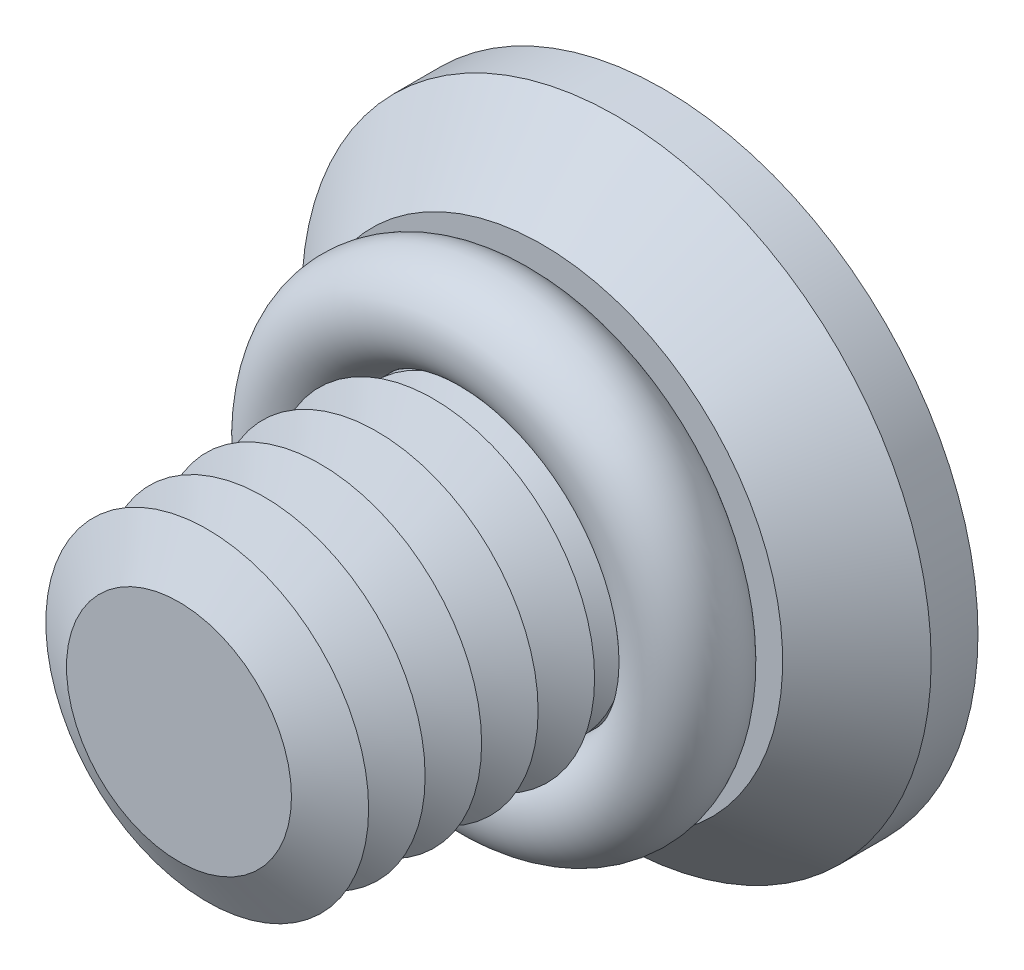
ISO-10303-21;
HEADER;
FILE_DESCRIPTION(('STEP AP214'),'2;1');
FILE_NAME('part.step','',(''),(''),'','','');
FILE_SCHEMA(('AUTOMOTIVE_DESIGN { 1 0 10303 214 1 1 1 1 }'));
ENDSEC;
DATA;
#1=APPLICATION_CONTEXT('core data for automotive mechanical design processes');
#2=APPLICATION_PROTOCOL_DEFINITION('international standard','automotive_design',2000,#1);
#3=PRODUCT_CONTEXT('',#1,'mechanical');
#4=PRODUCT('Part','Part','',(#3));
#5=PRODUCT_RELATED_PRODUCT_CATEGORY('part','',(#4));
#6=PRODUCT_DEFINITION_FORMATION('','',#4);
#7=PRODUCT_DEFINITION_CONTEXT('part definition',#1,'design');
#8=PRODUCT_DEFINITION('design','',#6,#7);
#9=PRODUCT_DEFINITION_SHAPE('','',#8);
#10=(LENGTH_UNIT() NAMED_UNIT(*) SI_UNIT(.MILLI.,.METRE.));
#11=(NAMED_UNIT(*) PLANE_ANGLE_UNIT() SI_UNIT($,.RADIAN.));
#12=(NAMED_UNIT(*) SI_UNIT($,.STERADIAN.) SOLID_ANGLE_UNIT());
#13=UNCERTAINTY_MEASURE_WITH_UNIT(LENGTH_MEASURE(1.E-05),#10,'distance_accuracy_value','');
#14=(GEOMETRIC_REPRESENTATION_CONTEXT(3) GLOBAL_UNCERTAINTY_ASSIGNED_CONTEXT((#13)) GLOBAL_UNIT_ASSIGNED_CONTEXT((#10,
#11,#12)) REPRESENTATION_CONTEXT('',''));
#15=CARTESIAN_POINT('',(0.,0.,0.));
#16=DIRECTION('',(0.,0.,1.));
#17=DIRECTION('',(1.,0.,0.));
#18=AXIS2_PLACEMENT_3D('',#15,#16,#17);
#19=CARTESIAN_POINT('',(0.,0.,2.1));
#20=DIRECTION('',(0.,0.,1.));
#21=DIRECTION('',(1.,0.,0.));
#22=AXIS2_PLACEMENT_3D('',#19,#20,#21);
#23=TOROIDAL_SURFACE('',#22,2.4,0.6);
#24=CARTESIAN_POINT('',(0.,2.4,2.1));
#25=DIRECTION('',(1.,0.,0.));
#26=DIRECTION('',(0.,0.,-1.));
#27=AXIS2_PLACEMENT_3D('',#24,#25,#26);
#28=CIRCLE('',#27,0.6);
#29=CARTESIAN_POINT('',(0.,3.,2.1));
#30=VERTEX_POINT('',#29);
#31=EDGE_CURVE('P0_E10',#30,#30,#28,.T.);
#32=CARTESIAN_POINT('',(0.,0.,2.1));
#33=DIRECTION('',(0.,0.,1.));
#34=DIRECTION('',(1.,0.,0.));
#35=AXIS2_PLACEMENT_3D('',#32,#33,#34);
#36=CIRCLE('',#35,3.);
#37=EDGE_CURVE('',#30,#30,#36,.T.);
#38=ORIENTED_EDGE('',*,*,#31,.F.);
#39=ORIENTED_EDGE('',*,*,#31,.T.);
#40=ORIENTED_EDGE('',*,*,#37,.T.);
#41=ORIENTED_EDGE('',*,*,#37,.F.);
#42=EDGE_LOOP('',(#38,#40,#39,#41));
#43=FACE_BOUND('',#42,.T.);
#44=ADVANCED_FACE('P0_F14',(#43),#23,.T.);
#45=CLOSED_SHELL('',(#44));
#46=MANIFOLD_SOLID_BREP('P0_B1',#45);
#47=CARTESIAN_POINT('',(0.,0.,3.2));
#48=DIRECTION('',(0.,0.,-1.));
#49=DIRECTION('',(-1.,0.,0.));
#50=AXIS2_PLACEMENT_3D('',#47,#48,#49);
#51=CONICAL_SURFACE('',#50,1.39378221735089,1.0471975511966);
#52=CARTESIAN_POINT('',(0.,0.,2.85));
#53=DIRECTION('',(0.,0.,1.));
#54=DIRECTION('',(1.,0.,0.));
#55=AXIS2_PLACEMENT_3D('',#52,#53,#54);
#56=CIRCLE('',#55,2.);
#57=CARTESIAN_POINT('',(2.,0.,2.85));
#58=VERTEX_POINT('',#57);
#59=EDGE_CURVE('P1_E310',#58,#58,#56,.T.);
#60=ORIENTED_EDGE('',*,*,#59,.T.);
#61=EDGE_LOOP('',(#60));
#62=FACE_BOUND('',#61,.T.);
#63=CARTESIAN_POINT('',(0.,0.,3.2));
#64=DIRECTION('',(0.,0.,1.));
#65=DIRECTION('',(1.,0.,0.));
#66=AXIS2_PLACEMENT_3D('',#63,#64,#65);
#67=CIRCLE('',#66,1.39378221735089);
#68=CARTESIAN_POINT('',(1.39378221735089,0.,3.2));
#69=VERTEX_POINT('',#68);
#70=EDGE_CURVE('P1_E307',#69,#69,#67,.T.);
#71=ORIENTED_EDGE('',*,*,#70,.F.);
#72=EDGE_LOOP('',(#71));
#73=FACE_BOUND('',#72,.T.);
#74=ADVANCED_FACE('P1_F15',(#62,#73),#51,.T.);
#75=CARTESIAN_POINT('',(0.,0.,3.55));
#76=DIRECTION('',(0.,0.,1.));
#77=DIRECTION('',(1.,0.,0.));
#78=AXIS2_PLACEMENT_3D('',#75,#76,#77);
#79=CONICAL_SURFACE('',#78,2.,1.0471975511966);
#80=ORIENTED_EDGE('',*,*,#70,.T.);
#81=EDGE_LOOP('',(#80));
#82=FACE_BOUND('',#81,.T.);
#83=CARTESIAN_POINT('',(0.,0.,3.55));
#84=DIRECTION('',(0.,0.,1.));
#85=DIRECTION('',(1.,0.,0.));
#86=AXIS2_PLACEMENT_3D('',#83,#84,#85);
#87=CIRCLE('',#86,2.);
#88=CARTESIAN_POINT('',(2.,0.,3.55));
#89=VERTEX_POINT('',#88);
#90=EDGE_CURVE('P1_E304',#89,#89,#87,.T.);
#91=ORIENTED_EDGE('',*,*,#90,.F.);
#92=EDGE_LOOP('',(#91));
#93=FACE_BOUND('',#92,.T.);
#94=ADVANCED_FACE('P1_F245',(#82,#93),#79,.T.);
#95=CARTESIAN_POINT('',(0.,0.,6.));
#96=DIRECTION('',(0.,0.,1.));
#97=DIRECTION('',(1.,0.,0.));
#98=AXIS2_PLACEMENT_3D('',#95,#96,#97);
#99=PLANE('',#98);
#100=CARTESIAN_POINT('',(0.,0.,6.));
#101=DIRECTION('',(0.,0.,1.));
#102=DIRECTION('',(1.,0.,0.));
#103=AXIS2_PLACEMENT_3D('',#100,#101,#102);
#104=CIRCLE('',#103,1.39378221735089);
#105=CARTESIAN_POINT('',(1.39378221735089,0.,6.));
#106=VERTEX_POINT('',#105);
#107=EDGE_CURVE('P1_E131',#106,#106,#104,.T.);
#108=ORIENTED_EDGE('',*,*,#107,.T.);
#109=EDGE_LOOP('',(#108));
#110=FACE_BOUND('',#109,.T.);
#111=ADVANCED_FACE('P1_F251',(#110),#99,.T.);
#112=CARTESIAN_POINT('',(0.,0.,6.));
#113=DIRECTION('',(0.,0.,-1.));
#114=DIRECTION('',(-1.,0.,0.));
#115=AXIS2_PLACEMENT_3D('',#112,#113,#114);
#116=CONICAL_SURFACE('',#115,1.39378221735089,1.0471975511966);
#117=CARTESIAN_POINT('',(0.,0.,5.65));
#118=DIRECTION('',(0.,0.,1.));
#119=DIRECTION('',(1.,0.,0.));
#120=AXIS2_PLACEMENT_3D('',#117,#118,#119);
#121=CIRCLE('',#120,2.);
#122=CARTESIAN_POINT('',(2.,0.,5.65));
#123=VERTEX_POINT('',#122);
#124=EDGE_CURVE('P1_E133',#123,#123,#121,.T.);
#125=ORIENTED_EDGE('',*,*,#124,.T.);
#126=EDGE_LOOP('',(#125));
#127=FACE_BOUND('',#126,.T.);
#128=ORIENTED_EDGE('',*,*,#107,.F.);
#129=EDGE_LOOP('',(#128));
#130=FACE_BOUND('',#129,.T.);
#131=ADVANCED_FACE('P1_F196',(#127,#130),#116,.T.);
#132=CARTESIAN_POINT('',(0.,0.,5.65));
#133=DIRECTION('',(0.,0.,1.));
#134=DIRECTION('',(1.,0.,0.));
#135=AXIS2_PLACEMENT_3D('',#132,#133,#134);
#136=CONICAL_SURFACE('',#135,2.,1.0471975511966);
#137=CARTESIAN_POINT('',(0.,0.,5.3));
#138=DIRECTION('',(0.,0.,1.));
#139=DIRECTION('',(1.,0.,0.));
#140=AXIS2_PLACEMENT_3D('',#137,#138,#139);
#141=CIRCLE('',#140,1.39378221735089);
#142=CARTESIAN_POINT('',(1.39378221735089,0.,5.3));
#143=VERTEX_POINT('',#142);
#144=EDGE_CURVE('P1_E289',#143,#143,#141,.T.);
#145=ORIENTED_EDGE('',*,*,#144,.T.);
#146=EDGE_LOOP('',(#145));
#147=FACE_BOUND('',#146,.T.);
#148=ORIENTED_EDGE('',*,*,#124,.F.);
#149=EDGE_LOOP('',(#148));
#150=FACE_BOUND('',#149,.T.);
#151=ADVANCED_FACE('P1_F276',(#147,#150),#136,.T.);
#152=CARTESIAN_POINT('',(0.,0.,5.3));
#153=DIRECTION('',(0.,0.,-1.));
#154=DIRECTION('',(-1.,0.,0.));
#155=AXIS2_PLACEMENT_3D('',#152,#153,#154);
#156=CONICAL_SURFACE('',#155,1.39378221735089,1.0471975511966);
#157=CARTESIAN_POINT('',(0.,0.,4.95));
#158=DIRECTION('',(0.,0.,1.));
#159=DIRECTION('',(1.,0.,0.));
#160=AXIS2_PLACEMENT_3D('',#157,#158,#159);
#161=CIRCLE('',#160,2.);
#162=CARTESIAN_POINT('',(2.,0.,4.95));
#163=VERTEX_POINT('',#162);
#164=EDGE_CURVE('P1_E286',#163,#163,#161,.T.);
#165=ORIENTED_EDGE('',*,*,#164,.T.);
#166=EDGE_LOOP('',(#165));
#167=FACE_BOUND('',#166,.T.);
#168=ORIENTED_EDGE('',*,*,#144,.F.);
#169=EDGE_LOOP('',(#168));
#170=FACE_BOUND('',#169,.T.);
#171=ADVANCED_FACE('P1_F271',(#167,#170),#156,.T.);
#172=CARTESIAN_POINT('',(0.,0.,4.95));
#173=DIRECTION('',(0.,0.,1.));
#174=DIRECTION('',(1.,0.,0.));
#175=AXIS2_PLACEMENT_3D('',#172,#173,#174);
#176=CONICAL_SURFACE('',#175,2.,1.0471975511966);
#177=CARTESIAN_POINT('',(0.,0.,4.6));
#178=DIRECTION('',(0.,0.,1.));
#179=DIRECTION('',(1.,0.,0.));
#180=AXIS2_PLACEMENT_3D('',#177,#178,#179);
#181=CIRCLE('',#180,1.39378221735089);
#182=CARTESIAN_POINT('',(1.39378221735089,0.,4.6));
#183=VERTEX_POINT('',#182);
#184=EDGE_CURVE('P1_E293',#183,#183,#181,.T.);
#185=ORIENTED_EDGE('',*,*,#184,.T.);
#186=EDGE_LOOP('',(#185));
#187=FACE_BOUND('',#186,.T.);
#188=ORIENTED_EDGE('',*,*,#164,.F.);
#189=EDGE_LOOP('',(#188));
#190=FACE_BOUND('',#189,.T.);
#191=ADVANCED_FACE('P1_F268',(#187,#190),#176,.T.);
#192=CARTESIAN_POINT('',(0.,0.,4.6));
#193=DIRECTION('',(0.,0.,-1.));
#194=DIRECTION('',(-1.,0.,0.));
#195=AXIS2_PLACEMENT_3D('',#192,#193,#194);
#196=CONICAL_SURFACE('',#195,1.39378221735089,1.0471975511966);
#197=CARTESIAN_POINT('',(0.,0.,4.25));
#198=DIRECTION('',(0.,0.,1.));
#199=DIRECTION('',(1.,0.,0.));
#200=AXIS2_PLACEMENT_3D('',#197,#198,#199);
#201=CIRCLE('',#200,2.);
#202=CARTESIAN_POINT('',(2.,0.,4.25));
#203=VERTEX_POINT('',#202);
#204=EDGE_CURVE('P1_E298',#203,#203,#201,.T.);
#205=ORIENTED_EDGE('',*,*,#204,.T.);
#206=EDGE_LOOP('',(#205));
#207=FACE_BOUND('',#206,.T.);
#208=ORIENTED_EDGE('',*,*,#184,.F.);
#209=EDGE_LOOP('',(#208));
#210=FACE_BOUND('',#209,.T.);
#211=ADVANCED_FACE('P1_F262',(#207,#210),#196,.T.);
#212=CARTESIAN_POINT('',(0.,0.,4.25));
#213=DIRECTION('',(0.,0.,1.));
#214=DIRECTION('',(1.,0.,0.));
#215=AXIS2_PLACEMENT_3D('',#212,#213,#214);
#216=CONICAL_SURFACE('',#215,2.,1.0471975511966);
#217=CARTESIAN_POINT('',(0.,0.,3.9));
#218=DIRECTION('',(0.,0.,1.));
#219=DIRECTION('',(1.,0.,0.));
#220=AXIS2_PLACEMENT_3D('',#217,#218,#219);
#221=CIRCLE('',#220,1.39378221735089);
#222=CARTESIAN_POINT('',(1.39378221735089,0.,3.9));
#223=VERTEX_POINT('',#222);
#224=EDGE_CURVE('P1_E301',#223,#223,#221,.T.);
#225=ORIENTED_EDGE('',*,*,#224,.T.);
#226=EDGE_LOOP('',(#225));
#227=FACE_BOUND('',#226,.T.);
#228=ORIENTED_EDGE('',*,*,#204,.F.);
#229=EDGE_LOOP('',(#228));
#230=FACE_BOUND('',#229,.T.);
#231=ADVANCED_FACE('P1_F258',(#227,#230),#216,.T.);
#232=CARTESIAN_POINT('',(0.,0.,3.9));
#233=DIRECTION('',(0.,0.,-1.));
#234=DIRECTION('',(-1.,0.,0.));
#235=AXIS2_PLACEMENT_3D('',#232,#233,#234);
#236=CONICAL_SURFACE('',#235,1.39378221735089,1.0471975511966);
#237=ORIENTED_EDGE('',*,*,#90,.T.);
#238=EDGE_LOOP('',(#237));
#239=FACE_BOUND('',#238,.T.);
#240=ORIENTED_EDGE('',*,*,#224,.F.);
#241=EDGE_LOOP('',(#240));
#242=FACE_BOUND('',#241,.T.);
#243=ADVANCED_FACE('P1_F261',(#239,#242),#236,.T.);
#244=CARTESIAN_POINT('',(0.,0.,2.5));
#245=DIRECTION('',(0.,0.,-1.));
#246=DIRECTION('',(-1.,0.,0.));
#247=AXIS2_PLACEMENT_3D('',#244,#245,#246);
#248=CONICAL_SURFACE('',#247,1.39378221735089,1.0471975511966);
#249=CARTESIAN_POINT('',(0.,0.,2.5));
#250=DIRECTION('',(0.,0.,1.));
#251=DIRECTION('',(1.,0.,0.));
#252=AXIS2_PLACEMENT_3D('',#249,#250,#251);
#253=CIRCLE('',#252,1.39378221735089);
#254=CARTESIAN_POINT('',(1.39378221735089,0.,2.5));
#255=VERTEX_POINT('',#254);
#256=EDGE_CURVE('P1_E312',#255,#255,#253,.T.);
#257=ORIENTED_EDGE('',*,*,#256,.F.);
#258=EDGE_LOOP('',(#257));
#259=FACE_BOUND('',#258,.T.);
#260=CARTESIAN_POINT('',(0.,0.,2.26547005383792));
#261=DIRECTION('',(0.,0.,-1.));
#262=DIRECTION('',(-1.,0.,0.));
#263=AXIS2_PLACEMENT_3D('',#260,#261,#262);
#264=CIRCLE('',#263,1.8);
#265=CARTESIAN_POINT('',(-1.8,0.,2.26547005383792));
#266=VERTEX_POINT('',#265);
#267=EDGE_CURVE('P1_E19',#266,#266,#264,.F.);
#268=ORIENTED_EDGE('',*,*,#267,.T.);
#269=EDGE_LOOP('',(#268));
#270=FACE_BOUND('',#269,.T.);
#271=ADVANCED_FACE('P1_F266',(#259,#270),#248,.T.);
#272=CARTESIAN_POINT('',(0.,0.,2.85));
#273=DIRECTION('',(0.,0.,1.));
#274=DIRECTION('',(1.,0.,0.));
#275=AXIS2_PLACEMENT_3D('',#272,#273,#274);
#276=CONICAL_SURFACE('',#275,2.,1.0471975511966);
#277=ORIENTED_EDGE('',*,*,#256,.T.);
#278=EDGE_LOOP('',(#277));
#279=FACE_BOUND('',#278,.T.);
#280=ORIENTED_EDGE('',*,*,#59,.F.);
#281=EDGE_LOOP('',(#280));
#282=FACE_BOUND('',#281,.T.);
#283=ADVANCED_FACE('P1_F316',(#279,#282),#276,.T.);
#284=CARTESIAN_POINT('',(0.,0.,1.5));
#285=DIRECTION('',(0.,0.,-1.));
#286=DIRECTION('',(-1.,0.,0.));
#287=AXIS2_PLACEMENT_3D('',#284,#285,#286);
#288=CONICAL_SURFACE('',#287,1.25,1.0471975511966);
#289=CARTESIAN_POINT('',(0.,0.,2.22168783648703));
#290=VERTEX_POINT('',#289);
#291=VERTEX_LOOP('',#290);
#292=FACE_BOUND('',#291,.T.);
#293=CARTESIAN_POINT('',(0.,0.,1.5));
#294=DIRECTION('',(0.,0.,-1.));
#295=DIRECTION('',(-1.,0.,0.));
#296=AXIS2_PLACEMENT_3D('',#293,#294,#295);
#297=CIRCLE('',#296,1.25);
#298=CARTESIAN_POINT('',(-1.25,0.,1.5));
#299=VERTEX_POINT('',#298);
#300=CARTESIAN_POINT('',(-0.625,1.08253175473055,1.5));
#301=VERTEX_POINT('',#300);
#302=EDGE_CURVE('P1_E117',#299,#301,#297,.T.);
#303=ORIENTED_EDGE('',*,*,#302,.T.);
#304=CARTESIAN_POINT('',(0.,0.,1.5));
#305=DIRECTION('',(0.,0.,-1.));
#306=DIRECTION('',(-1.,0.,0.));
#307=AXIS2_PLACEMENT_3D('',#304,#305,#306);
#308=CIRCLE('',#307,1.25);
#309=CARTESIAN_POINT('',(0.625,1.08253175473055,1.5));
#310=VERTEX_POINT('',#309);
#311=EDGE_CURVE('P1_E24',#301,#310,#308,.T.);
#312=ORIENTED_EDGE('',*,*,#311,.T.);
#313=CARTESIAN_POINT('',(1.25,0.,1.5));
#314=VERTEX_POINT('',#313);
#315=EDGE_CURVE('P1_E609',#310,#314,#308,.T.);
#316=ORIENTED_EDGE('',*,*,#315,.T.);
#317=CARTESIAN_POINT('',(0.625,-1.08253175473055,1.5));
#318=VERTEX_POINT('',#317);
#319=EDGE_CURVE('P1_E602',#314,#318,#308,.T.);
#320=ORIENTED_EDGE('',*,*,#319,.T.);
#321=CARTESIAN_POINT('',(-0.624999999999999,-1.08253175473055,1.5));
#322=VERTEX_POINT('',#321);
#323=EDGE_CURVE('P1_E182',#318,#322,#308,.T.);
#324=ORIENTED_EDGE('',*,*,#323,.T.);
#325=EDGE_CURVE('P1_E179',#322,#299,#308,.T.);
#326=ORIENTED_EDGE('',*,*,#325,.T.);
#327=EDGE_LOOP('',(#303,#312,#316,#320,#324,#326));
#328=FACE_BOUND('',#327,.T.);
#329=ADVANCED_FACE('P1_F198',(#292,#328),#288,.F.);
#330=CARTESIAN_POINT('',(0.,0.,1.5));
#331=DIRECTION('',(0.,0.,-1.));
#332=DIRECTION('',(-1.,0.,0.));
#333=AXIS2_PLACEMENT_3D('',#330,#331,#332);
#334=PLANE('',#333);
#335=ORIENTED_EDGE('',*,*,#323,.F.);
#336=DIRECTION('',(-0.866025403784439,-0.5,0.));
#337=VECTOR('',#336,1.);
#338=CARTESIAN_POINT('',(1.25,-0.721687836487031,1.5));
#339=LINE('',#338,#337);
#340=CARTESIAN_POINT('',(0.,-1.44337567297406,1.5));
#341=VERTEX_POINT('',#340);
#342=EDGE_CURVE('P1_E618',#318,#341,#339,.T.);
#343=ORIENTED_EDGE('',*,*,#342,.T.);
#344=DIRECTION('',(-0.866025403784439,0.5,0.));
#345=VECTOR('',#344,1.);
#346=CARTESIAN_POINT('',(0.,-1.44337567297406,1.5));
#347=LINE('',#346,#345);
#348=EDGE_CURVE('P1_E625',#341,#322,#347,.T.);
#349=ORIENTED_EDGE('',*,*,#348,.T.);
#350=EDGE_LOOP('',(#335,#343,#349));
#351=FACE_BOUND('',#350,.T.);
#352=ADVANCED_FACE('P1_F419',(#351),#334,.T.);
#353=ORIENTED_EDGE('',*,*,#325,.F.);
#354=CARTESIAN_POINT('',(-1.25,-0.721687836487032,1.5));
#355=VERTEX_POINT('',#354);
#356=EDGE_CURVE('P1_E628',#322,#355,#347,.T.);
#357=ORIENTED_EDGE('',*,*,#356,.T.);
#358=DIRECTION('',(0.,1.,0.));
#359=VECTOR('',#358,1.);
#360=CARTESIAN_POINT('',(-1.25,-0.721687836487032,1.5));
#361=LINE('',#360,#359);
#362=EDGE_CURVE('P1_E123',#355,#299,#361,.T.);
#363=ORIENTED_EDGE('',*,*,#362,.T.);
#364=EDGE_LOOP('',(#353,#357,#363));
#365=FACE_BOUND('',#364,.T.);
#366=ADVANCED_FACE('P1_F231',(#365),#334,.T.);
#367=ORIENTED_EDGE('',*,*,#302,.F.);
#368=CARTESIAN_POINT('',(-1.25,0.721687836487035,1.5));
#369=VERTEX_POINT('',#368);
#370=EDGE_CURVE('P1_E630',#299,#369,#361,.T.);
#371=ORIENTED_EDGE('',*,*,#370,.T.);
#372=DIRECTION('',(0.866025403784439,0.5,0.));
#373=VECTOR('',#372,1.);
#374=CARTESIAN_POINT('',(-1.25,0.721687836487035,1.5));
#375=LINE('',#374,#373);
#376=EDGE_CURVE('P1_E633',#369,#301,#375,.T.);
#377=ORIENTED_EDGE('',*,*,#376,.T.);
#378=EDGE_LOOP('',(#367,#371,#377));
#379=FACE_BOUND('',#378,.T.);
#380=ADVANCED_FACE('P1_F436',(#379),#334,.T.);
#381=ORIENTED_EDGE('',*,*,#311,.F.);
#382=CARTESIAN_POINT('',(0.,1.44337567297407,1.5));
#383=VERTEX_POINT('',#382);
#384=EDGE_CURVE('P1_E632',#301,#383,#375,.T.);
#385=ORIENTED_EDGE('',*,*,#384,.T.);
#386=DIRECTION('',(0.866025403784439,-0.5,0.));
#387=VECTOR('',#386,1.);
#388=CARTESIAN_POINT('',(0.,1.44337567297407,1.5));
#389=LINE('',#388,#387);
#390=EDGE_CURVE('P1_E161',#383,#310,#389,.T.);
#391=ORIENTED_EDGE('',*,*,#390,.T.);
#392=EDGE_LOOP('',(#381,#385,#391));
#393=FACE_BOUND('',#392,.T.);
#394=ADVANCED_FACE('P1_F445',(#393),#334,.T.);
#395=ORIENTED_EDGE('',*,*,#315,.F.);
#396=CARTESIAN_POINT('',(1.25,0.721687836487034,1.5));
#397=VERTEX_POINT('',#396);
#398=EDGE_CURVE('P1_E617',#310,#397,#389,.T.);
#399=ORIENTED_EDGE('',*,*,#398,.T.);
#400=DIRECTION('',(0.,-1.,0.));
#401=VECTOR('',#400,1.);
#402=CARTESIAN_POINT('',(1.25,0.721687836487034,1.5));
#403=LINE('',#402,#401);
#404=EDGE_CURVE('P1_E612',#397,#314,#403,.T.);
#405=ORIENTED_EDGE('',*,*,#404,.T.);
#406=EDGE_LOOP('',(#395,#399,#405));
#407=FACE_BOUND('',#406,.T.);
#408=ADVANCED_FACE('P1_F455',(#407),#334,.T.);
#409=ORIENTED_EDGE('',*,*,#319,.F.);
#410=CARTESIAN_POINT('',(1.25,-0.721687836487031,1.5));
#411=VERTEX_POINT('',#410);
#412=EDGE_CURVE('P1_E604',#314,#411,#403,.T.);
#413=ORIENTED_EDGE('',*,*,#412,.T.);
#414=EDGE_CURVE('P1_E125',#411,#318,#339,.T.);
#415=ORIENTED_EDGE('',*,*,#414,.T.);
#416=EDGE_LOOP('',(#409,#413,#415));
#417=FACE_BOUND('',#416,.T.);
#418=ADVANCED_FACE('P1_F229',(#417),#334,.T.);
#419=CARTESIAN_POINT('',(1.25,-0.721687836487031,1.5));
#420=DIRECTION('',(0.5,-0.866025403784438,0.));
#421=DIRECTION('',(0.866025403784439,0.5,0.));
#422=AXIS2_PLACEMENT_3D('',#419,#420,#421);
#423=PLANE('',#422);
#424=DIRECTION('',(0.,0.,-1.));
#425=VECTOR('',#424,1.);
#426=CARTESIAN_POINT('',(1.25,-0.721687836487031,1.5));
#427=LINE('',#426,#425);
#428=CARTESIAN_POINT('',(1.25,-0.72168783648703,0.));
#429=VERTEX_POINT('',#428);
#430=EDGE_CURVE('P1_E164',#411,#429,#427,.T.);
#431=ORIENTED_EDGE('',*,*,#430,.T.);
#432=CARTESIAN_POINT('',(1.2502,-0.721572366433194,-3.09438201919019E-05));
#433=CARTESIAN_POINT('',(1.19827409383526,-0.751551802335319,0.00800698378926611));
#434=CARTESIAN_POINT('',(1.14625401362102,-0.781585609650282,0.0153042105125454));
#435=CARTESIAN_POINT('',(1.04203006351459,-0.841759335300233,0.0281248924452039));
#436=CARTESIAN_POINT('',(0.989826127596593,-0.871899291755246,0.0336476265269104));
#437=CARTESIAN_POINT('',(0.88555111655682,-0.93210249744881,0.0425967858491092));
#438=CARTESIAN_POINT('',(0.83348074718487,-0.962165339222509,0.0460338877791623));
#439=CARTESIAN_POINT('',(0.729273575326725,-1.0223293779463,0.0506427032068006));
#440=CARTESIAN_POINT('',(0.677136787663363,-1.05243056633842,0.0518148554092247));
#441=CARTESIAN_POINT('',(0.572863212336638,-1.11263294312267,0.0518148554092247));
#442=CARTESIAN_POINT('',(0.520726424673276,-1.1427341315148,0.0506427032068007));
#443=CARTESIAN_POINT('',(0.416519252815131,-1.20289817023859,0.0460338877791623));
#444=CARTESIAN_POINT('',(0.364448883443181,-1.23296101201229,0.0425967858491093));
#445=CARTESIAN_POINT('',(0.260173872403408,-1.29316421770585,0.0336476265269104));
#446=CARTESIAN_POINT('',(0.207969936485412,-1.32330417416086,0.028124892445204));
#447=CARTESIAN_POINT('',(0.103745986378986,-1.38347789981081,0.0153042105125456));
#448=CARTESIAN_POINT('',(0.051725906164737,-1.41351170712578,0.00800698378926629));
#449=CARTESIAN_POINT('',(-0.000199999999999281,-1.4434911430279,-3.09438201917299E-05));
#450=B_SPLINE_CURVE_WITH_KNOTS('',3,(#432,#433,#434,#435,#436,#437,#438,#439,#440,#441,#442,
#443,#444,#445,#446,#447,#448,#449),.UNSPECIFIED.,.F.,.F.,(4,2,2,2,2,2,2,2,4),(0.,
0.18149525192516,0.363064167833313,0.543695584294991,0.724292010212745,0.904888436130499,
1.08551985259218,1.26708876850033,1.44858402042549),.UNSPECIFIED.);
#451=CARTESIAN_POINT('',(0.,-1.44337567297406,0.));
#452=VERTEX_POINT('',#451);
#453=EDGE_CURVE('P1_E118',#429,#452,#450,.T.);
#454=ORIENTED_EDGE('',*,*,#453,.T.);
#455=DIRECTION('',(0.,0.,-1.));
#456=VECTOR('',#455,1.);
#457=CARTESIAN_POINT('',(0.,-1.44337567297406,1.5));
#458=LINE('',#457,#456);
#459=EDGE_CURVE('P1_E116',#341,#452,#458,.T.);
#460=ORIENTED_EDGE('',*,*,#459,.F.);
#461=ORIENTED_EDGE('',*,*,#342,.F.);
#462=ORIENTED_EDGE('',*,*,#414,.F.);
#463=EDGE_LOOP('',(#431,#454,#460,#461,#462));
#464=FACE_BOUND('',#463,.T.);
#465=ADVANCED_FACE('P1_F226',(#464),#423,.F.);
#466=CARTESIAN_POINT('',(0.,-1.44337567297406,1.5));
#467=DIRECTION('',(-0.5,-0.866025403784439,0.));
#468=DIRECTION('',(0.866025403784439,-0.5,0.));
#469=AXIS2_PLACEMENT_3D('',#466,#467,#468);
#470=PLANE('',#469);
#471=ORIENTED_EDGE('',*,*,#459,.T.);
#472=CARTESIAN_POINT('',(0.000200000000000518,-1.4434911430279,-3.094382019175E-05));
#473=CARTESIAN_POINT('',(-0.0517259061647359,-1.41351170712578,0.00800698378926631));
#474=CARTESIAN_POINT('',(-0.103745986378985,-1.38347789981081,0.0153042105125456));
#475=CARTESIAN_POINT('',(-0.207969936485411,-1.32330417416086,0.028124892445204));
#476=CARTESIAN_POINT('',(-0.260173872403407,-1.29316421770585,0.0336476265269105));
#477=CARTESIAN_POINT('',(-0.364448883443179,-1.23296101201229,0.0425967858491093));
#478=CARTESIAN_POINT('',(-0.41651925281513,-1.20289817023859,0.0460338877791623));
#479=CARTESIAN_POINT('',(-0.520726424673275,-1.1427341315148,0.0506427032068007));
#480=CARTESIAN_POINT('',(-0.572863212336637,-1.11263294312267,0.0518148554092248));
#481=CARTESIAN_POINT('',(-0.677136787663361,-1.05243056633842,0.0518148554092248));
#482=CARTESIAN_POINT('',(-0.729273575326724,-1.0223293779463,0.0506427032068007));
#483=CARTESIAN_POINT('',(-0.833480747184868,-0.96216533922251,0.0460338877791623));
#484=CARTESIAN_POINT('',(-0.885551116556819,-0.932102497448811,0.0425967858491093));
#485=CARTESIAN_POINT('',(-0.989826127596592,-0.871899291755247,0.0336476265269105));
#486=CARTESIAN_POINT('',(-1.04203006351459,-0.841759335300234,0.028124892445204));
#487=CARTESIAN_POINT('',(-1.14625401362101,-0.781585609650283,0.0153042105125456));
#488=CARTESIAN_POINT('',(-1.19827409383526,-0.75155180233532,0.00800698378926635));
#489=CARTESIAN_POINT('',(-1.2502,-0.721572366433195,-3.09438201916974E-05));
#490=B_SPLINE_CURVE_WITH_KNOTS('',3,(#472,#473,#474,#475,#476,#477,#478,#479,#480,#481,#482,
#483,#484,#485,#486,#487,#488,#489),.UNSPECIFIED.,.F.,.F.,(4,2,2,2,2,2,2,2,4),(0.,
0.18149525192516,0.363064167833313,0.543695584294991,0.724292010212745,0.904888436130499,
1.08551985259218,1.26708876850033,1.44858402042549),.UNSPECIFIED.);
#491=CARTESIAN_POINT('',(-1.25,-0.721687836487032,0.));
#492=VERTEX_POINT('',#491);
#493=EDGE_CURVE('P1_E94',#452,#492,#490,.T.);
#494=ORIENTED_EDGE('',*,*,#493,.T.);
#495=DIRECTION('',(0.,0.,-1.));
#496=VECTOR('',#495,1.);
#497=CARTESIAN_POINT('',(-1.25,-0.721687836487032,1.5));
#498=LINE('',#497,#496);
#499=EDGE_CURVE('P1_E112',#355,#492,#498,.T.);
#500=ORIENTED_EDGE('',*,*,#499,.F.);
#501=ORIENTED_EDGE('',*,*,#356,.F.);
#502=ORIENTED_EDGE('',*,*,#348,.F.);
#503=EDGE_LOOP('',(#471,#494,#500,#501,#502));
#504=FACE_BOUND('',#503,.T.);
#505=ADVANCED_FACE('P1_F110',(#504),#470,.F.);
#506=CARTESIAN_POINT('',(-1.25,-0.721687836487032,1.5));
#507=DIRECTION('',(-1.,0.,0.));
#508=DIRECTION('',(0.,-1.,0.));
#509=AXIS2_PLACEMENT_3D('',#506,#507,#508);
#510=PLANE('',#509);
#511=ORIENTED_EDGE('',*,*,#499,.T.);
#512=CARTESIAN_POINT('',(-1.25,-1.88400474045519,-0.21907305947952));
#513=CARTESIAN_POINT('',(-1.25,-1.8275611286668,-0.206472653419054));
#514=CARTESIAN_POINT('',(-1.25,-1.77108164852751,-0.194032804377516));
#515=CARTESIAN_POINT('',(-1.25,-1.65803301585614,-0.169555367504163));
#516=CARTESIAN_POINT('',(-1.25,-1.60146385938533,-0.157517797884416));
#517=CARTESIAN_POINT('',(-1.25,-1.43148763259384,-0.12210797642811));
#518=CARTESIAN_POINT('',(-1.25,-1.3179263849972,-0.0994645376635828));
#519=CARTESIAN_POINT('',(-1.25,-1.09123200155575,-0.0573237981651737));
#520=CARTESIAN_POINT('',(-1.25,-0.978103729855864,-0.0378008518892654));
#521=CARTESIAN_POINT('',(-1.25,-0.751170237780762,-0.00320860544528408));
#522=CARTESIAN_POINT('',(-1.25,-0.637365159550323,0.0118615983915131));
#523=CARTESIAN_POINT('',(-1.25,-0.407744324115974,0.0355899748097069));
#524=CARTESIAN_POINT('',(-1.25,-0.291920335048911,0.0441742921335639));
#525=CARTESIAN_POINT('',(-1.25,-0.117976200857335,0.0506819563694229));
#526=CARTESIAN_POINT('',(-1.25,-0.0599690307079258,0.0517900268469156));
#527=CARTESIAN_POINT('',(-1.25,0.0560463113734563,0.0518388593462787));
#528=CARTESIAN_POINT('',(-1.25,0.114054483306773,0.0507796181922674));
#529=CARTESIAN_POINT('',(-1.25,0.28842859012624,0.0443978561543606));
#530=CARTESIAN_POINT('',(-1.25,0.404683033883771,0.0358543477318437));
#531=CARTESIAN_POINT('',(-1.25,0.636524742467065,0.0119999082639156));
#532=CARTESIAN_POINT('',(-1.25,0.752111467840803,-0.00331588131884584));
#533=CARTESIAN_POINT('',(-1.25,0.985585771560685,-0.0389793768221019));
#534=CARTESIAN_POINT('',(-1.25,1.10345418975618,-0.0594485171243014));
#535=CARTESIAN_POINT('',(-1.25,1.33861792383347,-0.103481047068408));
#536=CARTESIAN_POINT('',(-1.25,1.45591314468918,-0.127044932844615));
#537=CARTESIAN_POINT('',(-1.25,1.69011362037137,-0.176177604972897));
#538=CARTESIAN_POINT('',(-1.25,1.80701875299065,-0.201746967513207));
#539=CARTESIAN_POINT('',(-1.25,2.04053091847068,-0.254214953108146));
#540=CARTESIAN_POINT('',(-1.25,2.15713794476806,-0.281113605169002));
#541=CARTESIAN_POINT('',(-1.25,2.38871499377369,-0.33548950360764));
#542=CARTESIAN_POINT('',(-1.25,2.50368762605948,-0.362955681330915));
#543=CARTESIAN_POINT('',(-1.25,2.7334816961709,-0.41852313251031));
#544=CARTESIAN_POINT('',(-1.25,2.84830313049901,-0.446624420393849));
#545=CARTESIAN_POINT('',(-1.25,3.07767157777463,-0.503250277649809));
#546=CARTESIAN_POINT('',(-1.25,3.19221875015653,-0.531774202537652));
#547=CARTESIAN_POINT('',(-1.25,3.42122038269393,-0.589174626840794));
#548=CARTESIAN_POINT('',(-1.25,3.53567484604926,-0.618051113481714));
#549=CARTESIAN_POINT('',(-1.25,3.65009781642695,-0.647050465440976));
#550=B_SPLINE_CURVE_WITH_KNOTS('',3,(#512,#513,#514,#515,#516,#517,#518,#519,#520,#521,#522,
#523,#524,#525,#526,#527,#528,#529,#530,#531,#532,#533,#534,#535,#536,#537,#538,#539,#540,#541,
#542,#543,#544,#545,#546,#547,#548,#549),.UNSPECIFIED.,.F.,.F.,(4,2,2,2,2,2,2,2,2,2,2,2,2,2,2,2,
2,2,4),(0.,0.173498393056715,0.347004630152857,0.694369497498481,1.03871380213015,
1.382988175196,1.73112607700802,1.90514173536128,2.07915764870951,2.42857002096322,
2.77823347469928,3.13706733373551,3.49595878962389,3.85495373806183,4.2139565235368,
4.56857767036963,4.92320688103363,5.27734186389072,5.63146405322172),.UNSPECIFIED.);
#551=CARTESIAN_POINT('',(-1.25,0.721687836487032,0.));
#552=VERTEX_POINT('',#551);
#553=EDGE_CURVE('P1_E10',#492,#552,#550,.T.);
#554=ORIENTED_EDGE('',*,*,#553,.T.);
#555=DIRECTION('',(0.,0.,-1.));
#556=VECTOR('',#555,1.);
#557=CARTESIAN_POINT('',(-1.25,0.721687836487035,1.5));
#558=LINE('',#557,#556);
#559=EDGE_CURVE('P1_E124',#369,#552,#558,.T.);
#560=ORIENTED_EDGE('',*,*,#559,.F.);
#561=ORIENTED_EDGE('',*,*,#370,.F.);
#562=ORIENTED_EDGE('',*,*,#362,.F.);
#563=EDGE_LOOP('',(#511,#554,#560,#561,#562));
#564=FACE_BOUND('',#563,.T.);
#565=ADVANCED_FACE('P1_F120',(#564),#510,.F.);
#566=CARTESIAN_POINT('',(-1.25,0.721687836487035,1.5));
#567=DIRECTION('',(-0.5,0.866025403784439,0.));
#568=DIRECTION('',(-0.866025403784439,-0.5,0.));
#569=AXIS2_PLACEMENT_3D('',#566,#567,#568);
#570=PLANE('',#569);
#571=ORIENTED_EDGE('',*,*,#559,.T.);
#572=CARTESIAN_POINT('',(-1.2502,0.721572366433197,-3.09438201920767E-05));
#573=CARTESIAN_POINT('',(-1.19827409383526,0.751551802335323,0.00800698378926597));
#574=CARTESIAN_POINT('',(-1.14625401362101,0.781585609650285,0.0153042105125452));
#575=CARTESIAN_POINT('',(-1.04203006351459,0.841759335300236,0.0281248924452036));
#576=CARTESIAN_POINT('',(-0.989826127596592,0.871899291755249,0.03364762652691));
#577=CARTESIAN_POINT('',(-0.885551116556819,0.932102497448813,0.0425967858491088));
#578=CARTESIAN_POINT('',(-0.833480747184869,0.962165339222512,0.0460338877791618));
#579=CARTESIAN_POINT('',(-0.729273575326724,1.0223293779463,0.0506427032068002));
#580=CARTESIAN_POINT('',(-0.677136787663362,1.05243056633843,0.0518148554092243));
#581=CARTESIAN_POINT('',(-0.572863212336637,1.11263294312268,0.0518148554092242));
#582=CARTESIAN_POINT('',(-0.520726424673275,1.1427341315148,0.0506427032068));
#583=CARTESIAN_POINT('',(-0.416519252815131,1.20289817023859,0.0460338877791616));
#584=CARTESIAN_POINT('',(-0.36444888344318,1.23296101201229,0.0425967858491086));
#585=CARTESIAN_POINT('',(-0.260173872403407,1.29316421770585,0.0336476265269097));
#586=CARTESIAN_POINT('',(-0.207969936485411,1.32330417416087,0.0281248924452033));
#587=CARTESIAN_POINT('',(-0.103745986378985,1.38347789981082,0.0153042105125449));
#588=CARTESIAN_POINT('',(-0.0517259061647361,1.41351170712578,0.00800698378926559));
#589=CARTESIAN_POINT('',(0.000200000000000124,1.4434911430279,-3.09438201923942E-05));
#590=B_SPLINE_CURVE_WITH_KNOTS('',3,(#572,#573,#574,#575,#576,#577,#578,#579,#580,#581,#582,
#583,#584,#585,#586,#587,#588,#589),.UNSPECIFIED.,.F.,.F.,(4,2,2,2,2,2,2,2,4),(0.,
0.18149525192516,0.363064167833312,0.543695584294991,0.724292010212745,0.904888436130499,
1.08551985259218,1.26708876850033,1.44858402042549),.UNSPECIFIED.);
#591=CARTESIAN_POINT('',(0.,1.44337567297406,0.));
#592=VERTEX_POINT('',#591);
#593=EDGE_CURVE('P1_E136',#552,#592,#590,.T.);
#594=ORIENTED_EDGE('',*,*,#593,.T.);
#595=DIRECTION('',(0.,0.,-1.));
#596=VECTOR('',#595,1.);
#597=CARTESIAN_POINT('',(0.,1.44337567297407,1.5));
#598=LINE('',#597,#596);
#599=EDGE_CURVE('P1_E155',#383,#592,#598,.T.);
#600=ORIENTED_EDGE('',*,*,#599,.F.);
#601=ORIENTED_EDGE('',*,*,#384,.F.);
#602=ORIENTED_EDGE('',*,*,#376,.F.);
#603=EDGE_LOOP('',(#571,#594,#600,#601,#602));
#604=FACE_BOUND('',#603,.T.);
#605=ADVANCED_FACE('P1_F153',(#604),#570,.F.);
#606=CARTESIAN_POINT('',(0.,1.44337567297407,1.5));
#607=DIRECTION('',(0.5,0.866025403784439,0.));
#608=DIRECTION('',(-0.866025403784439,0.5,0.));
#609=AXIS2_PLACEMENT_3D('',#606,#607,#608);
#610=PLANE('',#609);
#611=ORIENTED_EDGE('',*,*,#599,.T.);
#612=CARTESIAN_POINT('',(-0.000199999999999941,1.4434911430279,-3.09438201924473E-05));
#613=CARTESIAN_POINT('',(0.0517259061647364,1.41351170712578,0.00800698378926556));
#614=CARTESIAN_POINT('',(0.103745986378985,1.38347789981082,0.0153042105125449));
#615=CARTESIAN_POINT('',(0.207969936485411,1.32330417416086,0.0281248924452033));
#616=CARTESIAN_POINT('',(0.260173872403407,1.29316421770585,0.0336476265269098));
#617=CARTESIAN_POINT('',(0.36444888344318,1.23296101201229,0.0425967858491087));
#618=CARTESIAN_POINT('',(0.416519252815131,1.20289817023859,0.0460338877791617));
#619=CARTESIAN_POINT('',(0.520726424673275,1.1427341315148,0.0506427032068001));
#620=CARTESIAN_POINT('',(0.572863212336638,1.11263294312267,0.0518148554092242));
#621=CARTESIAN_POINT('',(0.677136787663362,1.05243056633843,0.0518148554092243));
#622=CARTESIAN_POINT('',(0.729273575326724,1.0223293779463,0.0506427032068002));
#623=CARTESIAN_POINT('',(0.833480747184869,0.962165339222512,0.0460338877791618));
#624=CARTESIAN_POINT('',(0.88555111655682,0.932102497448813,0.0425967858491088));
#625=CARTESIAN_POINT('',(0.989826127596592,0.871899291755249,0.03364762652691));
#626=CARTESIAN_POINT('',(1.04203006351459,0.841759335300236,0.0281248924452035));
#627=CARTESIAN_POINT('',(1.14625401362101,0.781585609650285,0.0153042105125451));
#628=CARTESIAN_POINT('',(1.19827409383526,0.751551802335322,0.00800698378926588));
#629=CARTESIAN_POINT('',(1.2502,0.721572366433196,-3.09438201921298E-05));
#630=B_SPLINE_CURVE_WITH_KNOTS('',3,(#612,#613,#614,#615,#616,#617,#618,#619,#620,#621,#622,
#623,#624,#625,#626,#627,#628,#629),.UNSPECIFIED.,.F.,.F.,(4,2,2,2,2,2,2,2,4),(0.,
0.18149525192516,0.363064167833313,0.543695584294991,0.724292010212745,0.904888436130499,
1.08551985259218,1.26708876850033,1.44858402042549),.UNSPECIFIED.);
#631=CARTESIAN_POINT('',(1.25,0.721687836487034,0.));
#632=VERTEX_POINT('',#631);
#633=EDGE_CURVE('P1_E141',#592,#632,#630,.T.);
#634=ORIENTED_EDGE('',*,*,#633,.T.);
#635=DIRECTION('',(0.,0.,-1.));
#636=VECTOR('',#635,1.);
#637=CARTESIAN_POINT('',(1.25,0.721687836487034,1.5));
#638=LINE('',#637,#636);
#639=EDGE_CURVE('P1_E162',#397,#632,#638,.T.);
#640=ORIENTED_EDGE('',*,*,#639,.F.);
#641=ORIENTED_EDGE('',*,*,#398,.F.);
#642=ORIENTED_EDGE('',*,*,#390,.F.);
#643=EDGE_LOOP('',(#611,#634,#640,#641,#642));
#644=FACE_BOUND('',#643,.T.);
#645=ADVANCED_FACE('P1_F158',(#644),#610,.F.);
#646=CARTESIAN_POINT('',(1.25,0.721687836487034,1.5));
#647=DIRECTION('',(1.,0.,0.));
#648=DIRECTION('',(0.,1.,0.));
#649=AXIS2_PLACEMENT_3D('',#646,#647,#648);
#650=PLANE('',#649);
#651=ORIENTED_EDGE('',*,*,#639,.T.);
#652=CARTESIAN_POINT('',(1.25,-1.88400474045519,-0.21907305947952));
#653=CARTESIAN_POINT('',(1.25,-1.8275611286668,-0.206472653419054));
#654=CARTESIAN_POINT('',(1.25,-1.77108164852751,-0.194032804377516));
#655=CARTESIAN_POINT('',(1.25,-1.65803301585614,-0.169555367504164));
#656=CARTESIAN_POINT('',(1.25,-1.60146385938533,-0.157517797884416));
#657=CARTESIAN_POINT('',(1.25,-1.43148763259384,-0.12210797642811));
#658=CARTESIAN_POINT('',(1.25,-1.3179263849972,-0.0994645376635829));
#659=CARTESIAN_POINT('',(1.25,-1.09123200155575,-0.0573237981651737));
#660=CARTESIAN_POINT('',(1.25,-0.978103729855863,-0.0378008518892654));
#661=CARTESIAN_POINT('',(1.25,-0.751170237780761,-0.00320860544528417));
#662=CARTESIAN_POINT('',(1.25,-0.637365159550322,0.0118615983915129));
#663=CARTESIAN_POINT('',(1.25,-0.407744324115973,0.0355899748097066));
#664=CARTESIAN_POINT('',(1.25,-0.29192033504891,0.0441742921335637));
#665=CARTESIAN_POINT('',(1.25,-0.117976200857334,0.0506819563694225));
#666=CARTESIAN_POINT('',(1.25,-0.0599690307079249,0.0517900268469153));
#667=CARTESIAN_POINT('',(1.25,0.0560463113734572,0.0518388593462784));
#668=CARTESIAN_POINT('',(1.25,0.114054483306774,0.050779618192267));
#669=CARTESIAN_POINT('',(1.25,0.288428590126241,0.0443978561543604));
#670=CARTESIAN_POINT('',(1.25,0.404683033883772,0.0358543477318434));
#671=CARTESIAN_POINT('',(1.25,0.636524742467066,0.0119999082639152));
#672=CARTESIAN_POINT('',(1.25,0.752111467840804,-0.00331588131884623));
#673=CARTESIAN_POINT('',(1.25,0.985585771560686,-0.0389793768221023));
#674=CARTESIAN_POINT('',(1.25,1.10345418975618,-0.0594485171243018));
#675=CARTESIAN_POINT('',(1.25,1.33861792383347,-0.103481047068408));
#676=CARTESIAN_POINT('',(1.25,1.45591314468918,-0.127044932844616));
#677=CARTESIAN_POINT('',(1.25,1.69011362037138,-0.176177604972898));
#678=CARTESIAN_POINT('',(1.25,1.80701875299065,-0.201746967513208));
#679=CARTESIAN_POINT('',(1.25,2.04053091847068,-0.254214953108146));
#680=CARTESIAN_POINT('',(1.25,2.15713794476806,-0.281113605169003));
#681=CARTESIAN_POINT('',(1.25,2.38871499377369,-0.33548950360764));
#682=CARTESIAN_POINT('',(1.25,2.50368762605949,-0.362955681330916));
#683=CARTESIAN_POINT('',(1.25,2.7334816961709,-0.418523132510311));
#684=CARTESIAN_POINT('',(1.25,2.84830313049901,-0.44662442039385));
#685=CARTESIAN_POINT('',(1.25,3.07767157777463,-0.503250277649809));
#686=CARTESIAN_POINT('',(1.25,3.19221875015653,-0.531774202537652));
#687=CARTESIAN_POINT('',(1.25,3.42122038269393,-0.589174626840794));
#688=CARTESIAN_POINT('',(1.25,3.53567484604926,-0.618051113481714));
#689=CARTESIAN_POINT('',(1.25,3.65009781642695,-0.647050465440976));
#690=B_SPLINE_CURVE_WITH_KNOTS('',3,(#652,#653,#654,#655,#656,#657,#658,#659,#660,#661,#662,
#663,#664,#665,#666,#667,#668,#669,#670,#671,#672,#673,#674,#675,#676,#677,#678,#679,#680,#681,
#682,#683,#684,#685,#686,#687,#688,#689),.UNSPECIFIED.,.F.,.F.,(4,2,2,2,2,2,2,2,2,2,2,2,2,2,2,2,
2,2,4),(0.,0.173498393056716,0.347004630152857,0.694369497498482,1.03871380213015,
1.382988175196,1.73112607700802,1.90514173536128,2.07915764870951,2.42857002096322,
2.77823347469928,3.13706733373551,3.49595878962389,3.85495373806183,4.2139565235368,
4.56857767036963,4.92320688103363,5.27734186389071,5.63146405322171),.UNSPECIFIED.);
#691=EDGE_CURVE('P1_E149',#632,#429,#690,.F.);
#692=ORIENTED_EDGE('',*,*,#691,.T.);
#693=ORIENTED_EDGE('',*,*,#430,.F.);
#694=ORIENTED_EDGE('',*,*,#412,.F.);
#695=ORIENTED_EDGE('',*,*,#404,.F.);
#696=EDGE_LOOP('',(#651,#692,#693,#694,#695));
#697=FACE_BOUND('',#696,.T.);
#698=ADVANCED_FACE('P1_F232',(#697),#650,.F.);
#699=CARTESIAN_POINT('',(0.,0.,0.));
#700=DIRECTION('',(0.,0.,-1.));
#701=DIRECTION('',(-1.,0.,0.));
#702=AXIS2_PLACEMENT_3D('',#699,#700,#701);
#703=CONICAL_SURFACE('',#702,1.44337567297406,1.30899693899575);
#704=CARTESIAN_POINT('',(0.,0.,0.));
#705=DIRECTION('',(0.,0.,-1.));
#706=DIRECTION('',(-1.,0.,0.));
#707=AXIS2_PLACEMENT_3D('',#704,#705,#706);
#708=CIRCLE('',#707,1.44337567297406);
#709=EDGE_CURVE('P1_E30',#429,#452,#708,.T.);
#710=ORIENTED_EDGE('',*,*,#709,.T.);
#711=ORIENTED_EDGE('',*,*,#453,.F.);
#712=EDGE_LOOP('',(#710,#711));
#713=FACE_BOUND('',#712,.T.);
#714=ADVANCED_FACE('P1_F195',(#713),#703,.F.);
#715=EDGE_CURVE('P1_E90',#452,#492,#708,.T.);
#716=ORIENTED_EDGE('',*,*,#715,.T.);
#717=ORIENTED_EDGE('',*,*,#493,.F.);
#718=EDGE_LOOP('',(#716,#717));
#719=FACE_BOUND('',#718,.T.);
#720=ADVANCED_FACE('P1_F92',(#719),#703,.F.);
#721=EDGE_CURVE('P1_E98',#492,#552,#708,.T.);
#722=ORIENTED_EDGE('',*,*,#721,.T.);
#723=ORIENTED_EDGE('',*,*,#553,.F.);
#724=EDGE_LOOP('',(#722,#723));
#725=FACE_BOUND('',#724,.T.);
#726=ADVANCED_FACE('P1_F102',(#725),#703,.F.);
#727=EDGE_CURVE('P1_E130',#552,#592,#708,.T.);
#728=ORIENTED_EDGE('',*,*,#727,.T.);
#729=ORIENTED_EDGE('',*,*,#593,.F.);
#730=EDGE_LOOP('',(#728,#729));
#731=FACE_BOUND('',#730,.T.);
#732=ADVANCED_FACE('P1_F530',(#731),#703,.F.);
#733=EDGE_CURVE('P1_E137',#592,#632,#708,.T.);
#734=ORIENTED_EDGE('',*,*,#733,.T.);
#735=ORIENTED_EDGE('',*,*,#633,.F.);
#736=EDGE_LOOP('',(#734,#735));
#737=FACE_BOUND('',#736,.T.);
#738=ADVANCED_FACE('P1_F144',(#737),#703,.F.);
#739=EDGE_CURVE('P1_E37',#632,#429,#708,.T.);
#740=ORIENTED_EDGE('',*,*,#739,.T.);
#741=ORIENTED_EDGE('',*,*,#691,.F.);
#742=EDGE_LOOP('',(#740,#741));
#743=FACE_BOUND('',#742,.T.);
#744=ADVANCED_FACE('P1_F516',(#743),#703,.F.);
#745=CARTESIAN_POINT('',(0.,0.,0.));
#746=DIRECTION('',(0.,0.,1.));
#747=DIRECTION('',(1.,0.,0.));
#748=AXIS2_PLACEMENT_3D('',#745,#746,#747);
#749=PLANE('',#748);
#750=ORIENTED_EDGE('',*,*,#739,.F.);
#751=ORIENTED_EDGE('',*,*,#733,.F.);
#752=ORIENTED_EDGE('',*,*,#727,.F.);
#753=ORIENTED_EDGE('',*,*,#721,.F.);
#754=ORIENTED_EDGE('',*,*,#715,.F.);
#755=ORIENTED_EDGE('',*,*,#709,.F.);
#756=EDGE_LOOP('',(#750,#751,#752,#753,#754,#755));
#757=FACE_BOUND('',#756,.T.);
#758=CARTESIAN_POINT('',(0.,0.,0.));
#759=DIRECTION('',(0.,0.,-1.));
#760=DIRECTION('',(-1.,0.,0.));
#761=AXIS2_PLACEMENT_3D('',#758,#759,#760);
#762=CIRCLE('',#761,3.9);
#763=CARTESIAN_POINT('',(-3.9,0.,0.));
#764=VERTEX_POINT('',#763);
#765=EDGE_CURVE('P1_E169',#764,#764,#762,.T.);
#766=ORIENTED_EDGE('',*,*,#765,.T.);
#767=EDGE_LOOP('',(#766));
#768=FACE_BOUND('',#767,.T.);
#769=ADVANCED_FACE('P1_F17',(#757,#768),#749,.F.);
#770=CARTESIAN_POINT('',(0.,0.,6.));
#771=DIRECTION('',(0.,0.,-1.));
#772=DIRECTION('',(-1.,0.,0.));
#773=AXIS2_PLACEMENT_3D('',#770,#771,#772);
#774=CYLINDRICAL_SURFACE('',#773,3.9);
#775=ORIENTED_EDGE('',*,*,#765,.F.);
#776=EDGE_LOOP('',(#775));
#777=FACE_BOUND('',#776,.T.);
#778=CARTESIAN_POINT('',(0.,0.,0.580000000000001));
#779=DIRECTION('',(0.,0.,-1.));
#780=DIRECTION('',(-1.,0.,0.));
#781=AXIS2_PLACEMENT_3D('',#778,#779,#780);
#782=CIRCLE('',#781,3.9);
#783=CARTESIAN_POINT('',(-3.9,0.,0.580000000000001));
#784=VERTEX_POINT('',#783);
#785=EDGE_CURVE('P1_E172',#784,#784,#782,.T.);
#786=ORIENTED_EDGE('',*,*,#785,.T.);
#787=EDGE_LOOP('',(#786));
#788=FACE_BOUND('',#787,.T.);
#789=ADVANCED_FACE('P1_F337',(#777,#788),#774,.T.);
#790=CARTESIAN_POINT('',(0.,0.,0.));
#791=DIRECTION('',(0.,0.,-1.));
#792=DIRECTION('',(-1.,0.,0.));
#793=AXIS2_PLACEMENT_3D('',#790,#791,#792);
#794=CONICAL_SURFACE('',#793,4.48,0.785398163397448);
#795=CARTESIAN_POINT('',(0.,0.,1.5));
#796=DIRECTION('',(0.,0.,-1.));
#797=DIRECTION('',(-1.,0.,0.));
#798=AXIS2_PLACEMENT_3D('',#795,#796,#797);
#799=CIRCLE('',#798,2.98);
#800=CARTESIAN_POINT('',(-2.98,0.,1.5));
#801=VERTEX_POINT('',#800);
#802=EDGE_CURVE('P1_E176',#801,#801,#799,.T.);
#803=ORIENTED_EDGE('',*,*,#802,.T.);
#804=EDGE_LOOP('',(#803));
#805=FACE_BOUND('',#804,.T.);
#806=ORIENTED_EDGE('',*,*,#785,.F.);
#807=EDGE_LOOP('',(#806));
#808=FACE_BOUND('',#807,.T.);
#809=ADVANCED_FACE('P1_F332',(#805,#808),#794,.T.);
#810=CARTESIAN_POINT('',(0.,1.8,1.5));
#811=DIRECTION('',(0.,0.,-1.));
#812=DIRECTION('',(-1.,0.,0.));
#813=AXIS2_PLACEMENT_3D('',#810,#811,#812);
#814=PLANE('',#813);
#815=CARTESIAN_POINT('',(0.,0.,1.5));
#816=DIRECTION('',(0.,0.,-1.));
#817=DIRECTION('',(-1.,0.,0.));
#818=AXIS2_PLACEMENT_3D('',#815,#816,#817);
#819=CIRCLE('',#818,1.8);
#820=CARTESIAN_POINT('',(-1.8,0.,1.5));
#821=VERTEX_POINT('',#820);
#822=EDGE_CURVE('P1_E173',#821,#821,#819,.T.);
#823=ORIENTED_EDGE('',*,*,#822,.T.);
#824=EDGE_LOOP('',(#823));
#825=FACE_BOUND('',#824,.T.);
#826=ORIENTED_EDGE('',*,*,#802,.F.);
#827=EDGE_LOOP('',(#826));
#828=FACE_BOUND('',#827,.T.);
#829=ADVANCED_FACE('P1_F326',(#825,#828),#814,.F.);
#830=CARTESIAN_POINT('',(0.,0.,0.));
#831=DIRECTION('',(0.,0.,-1.));
#832=DIRECTION('',(-1.,0.,0.));
#833=AXIS2_PLACEMENT_3D('',#830,#831,#832);
#834=CYLINDRICAL_SURFACE('',#833,1.8);
#835=ORIENTED_EDGE('',*,*,#822,.F.);
#836=EDGE_LOOP('',(#835));
#837=FACE_BOUND('',#836,.T.);
#838=ORIENTED_EDGE('',*,*,#267,.F.);
#839=EDGE_LOOP('',(#838));
#840=FACE_BOUND('',#839,.T.);
#841=ADVANCED_FACE('P1_F324',(#837,#840),#834,.T.);
#842=CLOSED_SHELL('',(#74,#94,#111,#131,#151,#171,#191,#211,#231,#243,#271,#283,#329,#352,#366,
#380,#394,#408,#418,#465,#505,#565,#605,#645,#698,#714,#720,#726,#732,#738,#744,#769,#789,#809,
#829,#841));
#843=MANIFOLD_SOLID_BREP('P1_B1',#842);
#844=ADVANCED_BREP_SHAPE_REPRESENTATION('',(#18,#46,#843),#14);
#845=SHAPE_DEFINITION_REPRESENTATION(#9,#844);
ENDSEC;
END-ISO-10303-21;
